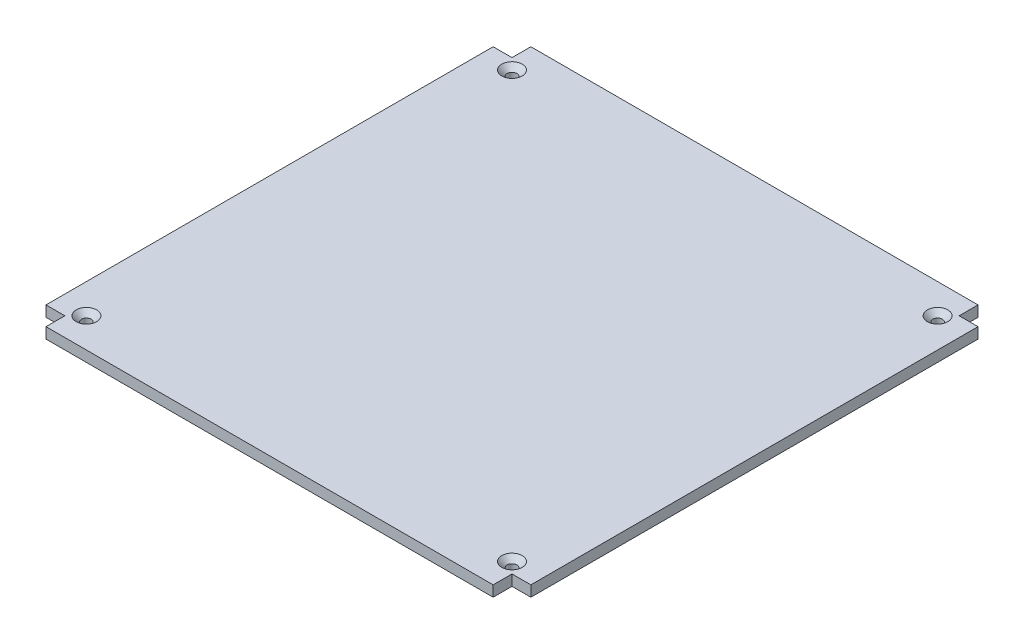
ISO-10303-21;
HEADER;
FILE_DESCRIPTION(('STEP AP214'),'2;1');
FILE_NAME('part.step','',(''),(''),'','','');
FILE_SCHEMA(('AUTOMOTIVE_DESIGN { 1 0 10303 214 1 1 1 1 }'));
ENDSEC;
DATA;
#1=APPLICATION_CONTEXT('core data for automotive mechanical design processes');
#2=APPLICATION_PROTOCOL_DEFINITION('international standard','automotive_design',2000,#1);
#3=PRODUCT_CONTEXT('',#1,'mechanical');
#4=PRODUCT('Part','Part','',(#3));
#5=PRODUCT_RELATED_PRODUCT_CATEGORY('part','',(#4));
#6=PRODUCT_DEFINITION_FORMATION('','',#4);
#7=PRODUCT_DEFINITION_CONTEXT('part definition',#1,'design');
#8=PRODUCT_DEFINITION('design','',#6,#7);
#9=PRODUCT_DEFINITION_SHAPE('','',#8);
#10=(LENGTH_UNIT() NAMED_UNIT(*) SI_UNIT(.MILLI.,.METRE.));
#11=(NAMED_UNIT(*) PLANE_ANGLE_UNIT() SI_UNIT($,.RADIAN.));
#12=(NAMED_UNIT(*) SI_UNIT($,.STERADIAN.) SOLID_ANGLE_UNIT());
#13=UNCERTAINTY_MEASURE_WITH_UNIT(LENGTH_MEASURE(1.E-05),#10,'distance_accuracy_value','');
#14=(GEOMETRIC_REPRESENTATION_CONTEXT(3) GLOBAL_UNCERTAINTY_ASSIGNED_CONTEXT((#13)) GLOBAL_UNIT_ASSIGNED_CONTEXT((#10,
#11,#12)) REPRESENTATION_CONTEXT('',''));
#15=CARTESIAN_POINT('',(0.,0.,0.));
#16=DIRECTION('',(0.,0.,1.));
#17=DIRECTION('',(1.,0.,0.));
#18=AXIS2_PLACEMENT_3D('',#15,#16,#17);
#19=CARTESIAN_POINT('',(0.,50.,0.));
#20=DIRECTION('',(0.,1.,0.));
#21=DIRECTION('',(0.,0.,1.));
#22=AXIS2_PLACEMENT_3D('',#19,#20,#21);
#23=PLANE('',#22);
#24=CARTESIAN_POINT('',(-39.5,50.,39.5));
#25=DIRECTION('',(0.,1.,0.));
#26=DIRECTION('',(0.,0.,1.));
#27=AXIS2_PLACEMENT_3D('',#24,#25,#26);
#28=CIRCLE('',#27,1.90000000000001);
#29=CARTESIAN_POINT('',(-39.5,50.,41.4));
#30=VERTEX_POINT('',#29);
#31=EDGE_CURVE('E215',#30,#30,#28,.F.);
#32=ORIENTED_EDGE('',*,*,#31,.T.);
#33=EDGE_LOOP('',(#32));
#34=FACE_BOUND('',#33,.T.);
#35=CARTESIAN_POINT('',(39.4999999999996,50.,39.5000000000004));
#36=DIRECTION('',(0.,1.,0.));
#37=DIRECTION('',(0.,0.,1.));
#38=AXIS2_PLACEMENT_3D('',#35,#36,#37);
#39=CIRCLE('',#38,1.90000000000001);
#40=CARTESIAN_POINT('',(39.4999999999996,50.,41.4000000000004));
#41=VERTEX_POINT('',#40);
#42=EDGE_CURVE('E212',#41,#41,#39,.F.);
#43=ORIENTED_EDGE('',*,*,#42,.T.);
#44=EDGE_LOOP('',(#43));
#45=FACE_BOUND('',#44,.T.);
#46=CARTESIAN_POINT('',(39.5,50.,-39.5));
#47=DIRECTION('',(0.,1.,0.));
#48=DIRECTION('',(0.,0.,1.));
#49=AXIS2_PLACEMENT_3D('',#46,#47,#48);
#50=CIRCLE('',#49,1.90000000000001);
#51=CARTESIAN_POINT('',(39.5,50.,-37.6));
#52=VERTEX_POINT('',#51);
#53=EDGE_CURVE('E209',#52,#52,#50,.F.);
#54=ORIENTED_EDGE('',*,*,#53,.T.);
#55=EDGE_LOOP('',(#54));
#56=FACE_BOUND('',#55,.T.);
#57=CARTESIAN_POINT('',(-39.4999999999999,50.,-39.5000000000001));
#58=DIRECTION('',(0.,1.,0.));
#59=DIRECTION('',(0.,0.,1.));
#60=AXIS2_PLACEMENT_3D('',#57,#58,#59);
#61=CIRCLE('',#60,1.90000000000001);
#62=CARTESIAN_POINT('',(-39.4999999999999,50.,-37.6000000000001));
#63=VERTEX_POINT('',#62);
#64=EDGE_CURVE('E206',#63,#63,#61,.F.);
#65=ORIENTED_EDGE('',*,*,#64,.T.);
#66=EDGE_LOOP('',(#65));
#67=FACE_BOUND('',#66,.T.);
#68=DIRECTION('',(1.,0.,-1.22917549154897E-13));
#69=VECTOR('',#68,1.);
#70=CARTESIAN_POINT('',(45.0000000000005,50.,41.5));
#71=LINE('',#70,#69);
#72=CARTESIAN_POINT('',(41.4999999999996,50.,41.5000000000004));
#73=VERTEX_POINT('',#72);
#74=CARTESIAN_POINT('',(45.0000000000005,50.,41.5));
#75=VERTEX_POINT('',#74);
#76=EDGE_CURVE('E176',#73,#75,#71,.T.);
#77=ORIENTED_EDGE('',*,*,#76,.T.);
#78=DIRECTION('',(0.,0.,-1.));
#79=VECTOR('',#78,1.);
#80=CARTESIAN_POINT('',(45.0000000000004,50.,-41.5));
#81=LINE('',#80,#79);
#82=CARTESIAN_POINT('',(45.0000000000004,50.,-41.5));
#83=VERTEX_POINT('',#82);
#84=EDGE_CURVE('E105',#75,#83,#81,.T.);
#85=ORIENTED_EDGE('',*,*,#84,.T.);
#86=DIRECTION('',(-1.,0.,0.));
#87=VECTOR('',#86,1.);
#88=CARTESIAN_POINT('',(45.0000000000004,50.,-41.5));
#89=LINE('',#88,#87);
#90=CARTESIAN_POINT('',(41.5,50.,-41.5));
#91=VERTEX_POINT('',#90);
#92=EDGE_CURVE('E324',#83,#91,#89,.T.);
#93=ORIENTED_EDGE('',*,*,#92,.T.);
#94=DIRECTION('',(0.,0.,-1.));
#95=VECTOR('',#94,1.);
#96=CARTESIAN_POINT('',(41.5,50.,-45.));
#97=LINE('',#96,#95);
#98=CARTESIAN_POINT('',(41.5,50.,-45.));
#99=VERTEX_POINT('',#98);
#100=EDGE_CURVE('E326',#91,#99,#97,.T.);
#101=ORIENTED_EDGE('',*,*,#100,.T.);
#102=DIRECTION('',(-1.,0.,0.));
#103=VECTOR('',#102,1.);
#104=CARTESIAN_POINT('',(41.5,50.,-45.));
#105=LINE('',#104,#103);
#106=CARTESIAN_POINT('',(-41.5,50.,-45.));
#107=VERTEX_POINT('',#106);
#108=EDGE_CURVE('E328',#99,#107,#105,.T.);
#109=ORIENTED_EDGE('',*,*,#108,.T.);
#110=DIRECTION('',(1.18952466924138E-13,0.,1.));
#111=VECTOR('',#110,1.);
#112=CARTESIAN_POINT('',(-41.5,50.,-45.));
#113=LINE('',#112,#111);
#114=CARTESIAN_POINT('',(-41.4999999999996,50.,-41.5000000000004));
#115=VERTEX_POINT('',#114);
#116=EDGE_CURVE('E330',#107,#115,#113,.T.);
#117=ORIENTED_EDGE('',*,*,#116,.T.);
#118=DIRECTION('',(-1.,0.,0.));
#119=VECTOR('',#118,1.);
#120=CARTESIAN_POINT('',(-45.0000000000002,50.,-41.5000000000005));
#121=LINE('',#120,#119);
#122=CARTESIAN_POINT('',(-45.0000000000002,50.,-41.5000000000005));
#123=VERTEX_POINT('',#122);
#124=EDGE_CURVE('E332',#115,#123,#121,.T.);
#125=ORIENTED_EDGE('',*,*,#124,.T.);
#126=DIRECTION('',(0.,0.,1.));
#127=VECTOR('',#126,1.);
#128=CARTESIAN_POINT('',(-45.0000000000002,50.,-41.5000000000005));
#129=LINE('',#128,#127);
#130=CARTESIAN_POINT('',(-45.0000000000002,50.,41.5));
#131=VERTEX_POINT('',#130);
#132=EDGE_CURVE('E334',#123,#131,#129,.T.);
#133=ORIENTED_EDGE('',*,*,#132,.T.);
#134=DIRECTION('',(1.,0.,0.));
#135=VECTOR('',#134,1.);
#136=CARTESIAN_POINT('',(-41.5,50.,41.5));
#137=LINE('',#136,#135);
#138=CARTESIAN_POINT('',(-41.5,50.,41.5));
#139=VERTEX_POINT('',#138);
#140=EDGE_CURVE('E135',#131,#139,#137,.T.);
#141=ORIENTED_EDGE('',*,*,#140,.T.);
#142=DIRECTION('',(0.,0.,1.));
#143=VECTOR('',#142,1.);
#144=CARTESIAN_POINT('',(-41.5,50.,45.));
#145=LINE('',#144,#143);
#146=CARTESIAN_POINT('',(-41.5,50.,45.));
#147=VERTEX_POINT('',#146);
#148=EDGE_CURVE('E130',#139,#147,#145,.T.);
#149=ORIENTED_EDGE('',*,*,#148,.T.);
#150=DIRECTION('',(1.,0.,0.));
#151=VECTOR('',#150,1.);
#152=CARTESIAN_POINT('',(41.4999999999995,50.,45.));
#153=LINE('',#152,#151);
#154=CARTESIAN_POINT('',(41.4999999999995,50.,45.));
#155=VERTEX_POINT('',#154);
#156=EDGE_CURVE('E133',#147,#155,#153,.T.);
#157=ORIENTED_EDGE('',*,*,#156,.T.);
#158=DIRECTION('',(0.,0.,-1.));
#159=VECTOR('',#158,1.);
#160=CARTESIAN_POINT('',(41.4999999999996,50.,41.5000000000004));
#161=LINE('',#160,#159);
#162=EDGE_CURVE('E49',#155,#73,#161,.T.);
#163=ORIENTED_EDGE('',*,*,#162,.T.);
#164=EDGE_LOOP('',(#77,#85,#93,#101,#109,#117,#125,#133,#141,#149,#157,#163));
#165=FACE_BOUND('',#164,.T.);
#166=ADVANCED_FACE('F32',(#34,#45,#56,#67,#165),#23,.T.);
#167=CARTESIAN_POINT('',(0.,48.,0.));
#168=DIRECTION('',(0.,1.,0.));
#169=DIRECTION('',(0.,0.,1.));
#170=AXIS2_PLACEMENT_3D('',#167,#168,#169);
#171=PLANE('',#170);
#172=DIRECTION('',(1.,0.,-1.22917549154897E-13));
#173=VECTOR('',#172,1.);
#174=CARTESIAN_POINT('',(45.0000000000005,48.,41.5));
#175=LINE('',#174,#173);
#176=CARTESIAN_POINT('',(41.4999999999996,48.,41.5000000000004));
#177=VERTEX_POINT('',#176);
#178=CARTESIAN_POINT('',(45.0000000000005,48.,41.5));
#179=VERTEX_POINT('',#178);
#180=EDGE_CURVE('E153',#177,#179,#175,.T.);
#181=ORIENTED_EDGE('',*,*,#180,.F.);
#182=DIRECTION('',(0.,0.,-1.));
#183=VECTOR('',#182,1.);
#184=CARTESIAN_POINT('',(41.4999999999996,48.,41.5000000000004));
#185=LINE('',#184,#183);
#186=CARTESIAN_POINT('',(41.4999999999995,48.,45.));
#187=VERTEX_POINT('',#186);
#188=EDGE_CURVE('E96',#187,#177,#185,.T.);
#189=ORIENTED_EDGE('',*,*,#188,.F.);
#190=DIRECTION('',(1.,0.,0.));
#191=VECTOR('',#190,1.);
#192=CARTESIAN_POINT('',(41.4999999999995,48.,45.));
#193=LINE('',#192,#191);
#194=CARTESIAN_POINT('',(-41.5,48.,45.));
#195=VERTEX_POINT('',#194);
#196=EDGE_CURVE('E90',#195,#187,#193,.T.);
#197=ORIENTED_EDGE('',*,*,#196,.F.);
#198=DIRECTION('',(0.,0.,1.));
#199=VECTOR('',#198,1.);
#200=CARTESIAN_POINT('',(-41.5,48.,45.));
#201=LINE('',#200,#199);
#202=CARTESIAN_POINT('',(-41.5,48.,41.5));
#203=VERTEX_POINT('',#202);
#204=EDGE_CURVE('E143',#203,#195,#201,.T.);
#205=ORIENTED_EDGE('',*,*,#204,.F.);
#206=DIRECTION('',(1.,0.,0.));
#207=VECTOR('',#206,1.);
#208=CARTESIAN_POINT('',(-41.5,48.,41.5));
#209=LINE('',#208,#207);
#210=CARTESIAN_POINT('',(-45.0000000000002,48.,41.5));
#211=VERTEX_POINT('',#210);
#212=EDGE_CURVE('E171',#211,#203,#209,.T.);
#213=ORIENTED_EDGE('',*,*,#212,.F.);
#214=DIRECTION('',(0.,0.,1.));
#215=VECTOR('',#214,1.);
#216=CARTESIAN_POINT('',(-45.0000000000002,48.,-41.5000000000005));
#217=LINE('',#216,#215);
#218=CARTESIAN_POINT('',(-45.0000000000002,48.,-41.5000000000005));
#219=VERTEX_POINT('',#218);
#220=EDGE_CURVE('E169',#219,#211,#217,.T.);
#221=ORIENTED_EDGE('',*,*,#220,.F.);
#222=DIRECTION('',(-1.,0.,0.));
#223=VECTOR('',#222,1.);
#224=CARTESIAN_POINT('',(-45.0000000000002,48.,-41.5000000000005));
#225=LINE('',#224,#223);
#226=CARTESIAN_POINT('',(-41.4999999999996,48.,-41.5000000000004));
#227=VERTEX_POINT('',#226);
#228=EDGE_CURVE('E167',#227,#219,#225,.T.);
#229=ORIENTED_EDGE('',*,*,#228,.F.);
#230=DIRECTION('',(1.18952466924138E-13,0.,1.));
#231=VECTOR('',#230,1.);
#232=CARTESIAN_POINT('',(-41.5,48.,-45.));
#233=LINE('',#232,#231);
#234=CARTESIAN_POINT('',(-41.5,48.,-45.));
#235=VERTEX_POINT('',#234);
#236=EDGE_CURVE('E165',#235,#227,#233,.T.);
#237=ORIENTED_EDGE('',*,*,#236,.F.);
#238=DIRECTION('',(-1.,0.,0.));
#239=VECTOR('',#238,1.);
#240=CARTESIAN_POINT('',(41.5,48.,-45.));
#241=LINE('',#240,#239);
#242=CARTESIAN_POINT('',(41.5,48.,-45.));
#243=VERTEX_POINT('',#242);
#244=EDGE_CURVE('E163',#243,#235,#241,.T.);
#245=ORIENTED_EDGE('',*,*,#244,.F.);
#246=DIRECTION('',(0.,0.,-1.));
#247=VECTOR('',#246,1.);
#248=CARTESIAN_POINT('',(41.5,48.,-45.));
#249=LINE('',#248,#247);
#250=CARTESIAN_POINT('',(41.5,48.,-41.5));
#251=VERTEX_POINT('',#250);
#252=EDGE_CURVE('E161',#251,#243,#249,.T.);
#253=ORIENTED_EDGE('',*,*,#252,.F.);
#254=DIRECTION('',(-1.,0.,0.));
#255=VECTOR('',#254,1.);
#256=CARTESIAN_POINT('',(45.0000000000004,48.,-41.5));
#257=LINE('',#256,#255);
#258=CARTESIAN_POINT('',(45.0000000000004,48.,-41.5));
#259=VERTEX_POINT('',#258);
#260=EDGE_CURVE('E159',#259,#251,#257,.T.);
#261=ORIENTED_EDGE('',*,*,#260,.F.);
#262=DIRECTION('',(0.,0.,-1.));
#263=VECTOR('',#262,1.);
#264=CARTESIAN_POINT('',(45.0000000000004,48.,-41.5));
#265=LINE('',#264,#263);
#266=EDGE_CURVE('E156',#179,#259,#265,.T.);
#267=ORIENTED_EDGE('',*,*,#266,.F.);
#268=EDGE_LOOP('',(#181,#189,#197,#205,#213,#221,#229,#237,#245,#253,#261,#267));
#269=FACE_BOUND('',#268,.T.);
#270=CARTESIAN_POINT('',(-39.4999999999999,48.,-39.5000000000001));
#271=DIRECTION('',(0.,1.,0.));
#272=DIRECTION('',(0.,0.,1.));
#273=AXIS2_PLACEMENT_3D('',#270,#271,#272);
#274=CIRCLE('',#273,0.900000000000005);
#275=CARTESIAN_POINT('',(-39.4999999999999,48.,-38.6000000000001));
#276=VERTEX_POINT('',#275);
#277=EDGE_CURVE('E157',#276,#276,#274,.T.);
#278=ORIENTED_EDGE('',*,*,#277,.T.);
#279=EDGE_LOOP('',(#278));
#280=FACE_BOUND('',#279,.T.);
#281=CARTESIAN_POINT('',(39.5,48.,-39.5));
#282=DIRECTION('',(0.,1.,0.));
#283=DIRECTION('',(0.,0.,1.));
#284=AXIS2_PLACEMENT_3D('',#281,#282,#283);
#285=CIRCLE('',#284,0.900000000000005);
#286=CARTESIAN_POINT('',(39.5,48.,-38.6));
#287=VERTEX_POINT('',#286);
#288=EDGE_CURVE('E315',#287,#287,#285,.T.);
#289=ORIENTED_EDGE('',*,*,#288,.T.);
#290=EDGE_LOOP('',(#289));
#291=FACE_BOUND('',#290,.T.);
#292=CARTESIAN_POINT('',(39.4999999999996,48.,39.5000000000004));
#293=DIRECTION('',(0.,1.,0.));
#294=DIRECTION('',(0.,0.,1.));
#295=AXIS2_PLACEMENT_3D('',#292,#293,#294);
#296=CIRCLE('',#295,0.900000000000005);
#297=CARTESIAN_POINT('',(39.4999999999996,48.,40.4000000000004));
#298=VERTEX_POINT('',#297);
#299=EDGE_CURVE('E312',#298,#298,#296,.T.);
#300=ORIENTED_EDGE('',*,*,#299,.T.);
#301=EDGE_LOOP('',(#300));
#302=FACE_BOUND('',#301,.T.);
#303=CARTESIAN_POINT('',(-39.5,48.,39.5));
#304=DIRECTION('',(0.,1.,0.));
#305=DIRECTION('',(0.,0.,1.));
#306=AXIS2_PLACEMENT_3D('',#303,#304,#305);
#307=CIRCLE('',#306,0.900000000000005);
#308=CARTESIAN_POINT('',(-39.5,48.,40.4));
#309=VERTEX_POINT('',#308);
#310=EDGE_CURVE('E310',#309,#309,#307,.T.);
#311=ORIENTED_EDGE('',*,*,#310,.T.);
#312=EDGE_LOOP('',(#311));
#313=FACE_BOUND('',#312,.T.);
#314=ADVANCED_FACE('F240',(#269,#280,#291,#302,#313),#171,.F.);
#315=CARTESIAN_POINT('',(45.0000000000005,50.,41.5));
#316=DIRECTION('',(-1.22917549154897E-13,0.,-1.));
#317=DIRECTION('',(-1.,0.,1.22917549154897E-13));
#318=AXIS2_PLACEMENT_3D('',#315,#316,#317);
#319=PLANE('',#318);
#320=ORIENTED_EDGE('',*,*,#180,.T.);
#321=DIRECTION('',(0.,-1.,0.));
#322=VECTOR('',#321,1.);
#323=CARTESIAN_POINT('',(45.0000000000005,50.,41.5));
#324=LINE('',#323,#322);
#325=EDGE_CURVE('E201',#75,#179,#324,.T.);
#326=ORIENTED_EDGE('',*,*,#325,.F.);
#327=ORIENTED_EDGE('',*,*,#76,.F.);
#328=DIRECTION('',(0.,-1.,0.));
#329=VECTOR('',#328,1.);
#330=CARTESIAN_POINT('',(41.4999999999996,50.,41.5000000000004));
#331=LINE('',#330,#329);
#332=EDGE_CURVE('E149',#73,#177,#331,.T.);
#333=ORIENTED_EDGE('',*,*,#332,.T.);
#334=EDGE_LOOP('',(#320,#326,#327,#333));
#335=FACE_BOUND('',#334,.T.);
#336=ADVANCED_FACE('F246',(#335),#319,.F.);
#337=CARTESIAN_POINT('',(45.0000000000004,50.,-41.5));
#338=DIRECTION('',(-1.,0.,0.));
#339=DIRECTION('',(0.,0.,1.));
#340=AXIS2_PLACEMENT_3D('',#337,#338,#339);
#341=PLANE('',#340);
#342=ORIENTED_EDGE('',*,*,#266,.T.);
#343=DIRECTION('',(0.,-1.,0.));
#344=VECTOR('',#343,1.);
#345=CARTESIAN_POINT('',(45.0000000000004,50.,-41.5));
#346=LINE('',#345,#344);
#347=EDGE_CURVE('E198',#83,#259,#346,.T.);
#348=ORIENTED_EDGE('',*,*,#347,.F.);
#349=ORIENTED_EDGE('',*,*,#84,.F.);
#350=ORIENTED_EDGE('',*,*,#325,.T.);
#351=EDGE_LOOP('',(#342,#348,#349,#350));
#352=FACE_BOUND('',#351,.T.);
#353=ADVANCED_FACE('F288',(#352),#341,.F.);
#354=CARTESIAN_POINT('',(45.0000000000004,50.,-41.5));
#355=DIRECTION('',(0.,0.,1.));
#356=DIRECTION('',(1.,0.,0.));
#357=AXIS2_PLACEMENT_3D('',#354,#355,#356);
#358=PLANE('',#357);
#359=ORIENTED_EDGE('',*,*,#260,.T.);
#360=DIRECTION('',(0.,-1.,0.));
#361=VECTOR('',#360,1.);
#362=CARTESIAN_POINT('',(41.5,50.,-41.5));
#363=LINE('',#362,#361);
#364=EDGE_CURVE('E195',#91,#251,#363,.T.);
#365=ORIENTED_EDGE('',*,*,#364,.F.);
#366=ORIENTED_EDGE('',*,*,#92,.F.);
#367=ORIENTED_EDGE('',*,*,#347,.T.);
#368=EDGE_LOOP('',(#359,#365,#366,#367));
#369=FACE_BOUND('',#368,.T.);
#370=ADVANCED_FACE('F284',(#369),#358,.F.);
#371=CARTESIAN_POINT('',(41.5,50.,-45.));
#372=DIRECTION('',(-1.,0.,0.));
#373=DIRECTION('',(0.,0.,1.));
#374=AXIS2_PLACEMENT_3D('',#371,#372,#373);
#375=PLANE('',#374);
#376=ORIENTED_EDGE('',*,*,#252,.T.);
#377=DIRECTION('',(0.,-1.,0.));
#378=VECTOR('',#377,1.);
#379=CARTESIAN_POINT('',(41.5,50.,-45.));
#380=LINE('',#379,#378);
#381=EDGE_CURVE('E192',#99,#243,#380,.T.);
#382=ORIENTED_EDGE('',*,*,#381,.F.);
#383=ORIENTED_EDGE('',*,*,#100,.F.);
#384=ORIENTED_EDGE('',*,*,#364,.T.);
#385=EDGE_LOOP('',(#376,#382,#383,#384));
#386=FACE_BOUND('',#385,.T.);
#387=ADVANCED_FACE('F280',(#386),#375,.F.);
#388=CARTESIAN_POINT('',(41.5,50.,-45.));
#389=DIRECTION('',(0.,0.,1.));
#390=DIRECTION('',(1.,0.,0.));
#391=AXIS2_PLACEMENT_3D('',#388,#389,#390);
#392=PLANE('',#391);
#393=ORIENTED_EDGE('',*,*,#244,.T.);
#394=DIRECTION('',(0.,-1.,0.));
#395=VECTOR('',#394,1.);
#396=CARTESIAN_POINT('',(-41.5,50.,-45.));
#397=LINE('',#396,#395);
#398=EDGE_CURVE('E189',#107,#235,#397,.T.);
#399=ORIENTED_EDGE('',*,*,#398,.F.);
#400=ORIENTED_EDGE('',*,*,#108,.F.);
#401=ORIENTED_EDGE('',*,*,#381,.T.);
#402=EDGE_LOOP('',(#393,#399,#400,#401));
#403=FACE_BOUND('',#402,.T.);
#404=ADVANCED_FACE('F276',(#403),#392,.F.);
#405=CARTESIAN_POINT('',(-41.5,50.,-45.));
#406=DIRECTION('',(1.,0.,-1.18952466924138E-13));
#407=DIRECTION('',(-1.18952466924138E-13,0.,-1.));
#408=AXIS2_PLACEMENT_3D('',#405,#406,#407);
#409=PLANE('',#408);
#410=ORIENTED_EDGE('',*,*,#236,.T.);
#411=DIRECTION('',(0.,-1.,0.));
#412=VECTOR('',#411,1.);
#413=CARTESIAN_POINT('',(-41.4999999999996,50.,-41.5000000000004));
#414=LINE('',#413,#412);
#415=EDGE_CURVE('E186',#115,#227,#414,.T.);
#416=ORIENTED_EDGE('',*,*,#415,.F.);
#417=ORIENTED_EDGE('',*,*,#116,.F.);
#418=ORIENTED_EDGE('',*,*,#398,.T.);
#419=EDGE_LOOP('',(#410,#416,#417,#418));
#420=FACE_BOUND('',#419,.T.);
#421=ADVANCED_FACE('F272',(#420),#409,.F.);
#422=CARTESIAN_POINT('',(-45.0000000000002,50.,-41.5000000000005));
#423=DIRECTION('',(0.,0.,1.));
#424=DIRECTION('',(1.,0.,0.));
#425=AXIS2_PLACEMENT_3D('',#422,#423,#424);
#426=PLANE('',#425);
#427=ORIENTED_EDGE('',*,*,#228,.T.);
#428=DIRECTION('',(0.,-1.,0.));
#429=VECTOR('',#428,1.);
#430=CARTESIAN_POINT('',(-45.0000000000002,50.,-41.5000000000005));
#431=LINE('',#430,#429);
#432=EDGE_CURVE('E183',#123,#219,#431,.T.);
#433=ORIENTED_EDGE('',*,*,#432,.F.);
#434=ORIENTED_EDGE('',*,*,#124,.F.);
#435=ORIENTED_EDGE('',*,*,#415,.T.);
#436=EDGE_LOOP('',(#427,#433,#434,#435));
#437=FACE_BOUND('',#436,.T.);
#438=ADVANCED_FACE('F268',(#437),#426,.F.);
#439=CARTESIAN_POINT('',(-45.0000000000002,50.,-41.5000000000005));
#440=DIRECTION('',(1.,0.,0.));
#441=DIRECTION('',(0.,0.,-1.));
#442=AXIS2_PLACEMENT_3D('',#439,#440,#441);
#443=PLANE('',#442);
#444=ORIENTED_EDGE('',*,*,#220,.T.);
#445=DIRECTION('',(0.,-1.,0.));
#446=VECTOR('',#445,1.);
#447=CARTESIAN_POINT('',(-45.0000000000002,50.,41.5));
#448=LINE('',#447,#446);
#449=EDGE_CURVE('E180',#131,#211,#448,.T.);
#450=ORIENTED_EDGE('',*,*,#449,.F.);
#451=ORIENTED_EDGE('',*,*,#132,.F.);
#452=ORIENTED_EDGE('',*,*,#432,.T.);
#453=EDGE_LOOP('',(#444,#450,#451,#452));
#454=FACE_BOUND('',#453,.T.);
#455=ADVANCED_FACE('F264',(#454),#443,.F.);
#456=CARTESIAN_POINT('',(-41.5,50.,41.5));
#457=DIRECTION('',(0.,0.,-1.));
#458=DIRECTION('',(-1.,0.,0.));
#459=AXIS2_PLACEMENT_3D('',#456,#457,#458);
#460=PLANE('',#459);
#461=ORIENTED_EDGE('',*,*,#212,.T.);
#462=DIRECTION('',(0.,-1.,0.));
#463=VECTOR('',#462,1.);
#464=CARTESIAN_POINT('',(-41.5,50.,41.5));
#465=LINE('',#464,#463);
#466=EDGE_CURVE('E144',#139,#203,#465,.T.);
#467=ORIENTED_EDGE('',*,*,#466,.F.);
#468=ORIENTED_EDGE('',*,*,#140,.F.);
#469=ORIENTED_EDGE('',*,*,#449,.T.);
#470=EDGE_LOOP('',(#461,#467,#468,#469));
#471=FACE_BOUND('',#470,.T.);
#472=ADVANCED_FACE('F261',(#471),#460,.F.);
#473=CARTESIAN_POINT('',(-41.5,50.,45.));
#474=DIRECTION('',(1.,0.,0.));
#475=DIRECTION('',(0.,0.,-1.));
#476=AXIS2_PLACEMENT_3D('',#473,#474,#475);
#477=PLANE('',#476);
#478=ORIENTED_EDGE('',*,*,#204,.T.);
#479=DIRECTION('',(0.,-1.,0.));
#480=VECTOR('',#479,1.);
#481=CARTESIAN_POINT('',(-41.5,50.,45.));
#482=LINE('',#481,#480);
#483=EDGE_CURVE('E140',#147,#195,#482,.T.);
#484=ORIENTED_EDGE('',*,*,#483,.F.);
#485=ORIENTED_EDGE('',*,*,#148,.F.);
#486=ORIENTED_EDGE('',*,*,#466,.T.);
#487=EDGE_LOOP('',(#478,#484,#485,#486));
#488=FACE_BOUND('',#487,.T.);
#489=ADVANCED_FACE('F141',(#488),#477,.F.);
#490=CARTESIAN_POINT('',(41.4999999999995,50.,45.));
#491=DIRECTION('',(0.,0.,-1.));
#492=DIRECTION('',(-1.,0.,0.));
#493=AXIS2_PLACEMENT_3D('',#490,#491,#492);
#494=PLANE('',#493);
#495=ORIENTED_EDGE('',*,*,#196,.T.);
#496=DIRECTION('',(0.,-1.,0.));
#497=VECTOR('',#496,1.);
#498=CARTESIAN_POINT('',(41.4999999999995,50.,45.));
#499=LINE('',#498,#497);
#500=EDGE_CURVE('E145',#155,#187,#499,.T.);
#501=ORIENTED_EDGE('',*,*,#500,.F.);
#502=ORIENTED_EDGE('',*,*,#156,.F.);
#503=ORIENTED_EDGE('',*,*,#483,.T.);
#504=EDGE_LOOP('',(#495,#501,#502,#503));
#505=FACE_BOUND('',#504,.T.);
#506=ADVANCED_FACE('F147',(#505),#494,.F.);
#507=CARTESIAN_POINT('',(41.4999999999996,50.,41.5000000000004));
#508=DIRECTION('',(-1.,0.,0.));
#509=DIRECTION('',(0.,0.,1.));
#510=AXIS2_PLACEMENT_3D('',#507,#508,#509);
#511=PLANE('',#510);
#512=ORIENTED_EDGE('',*,*,#188,.T.);
#513=ORIENTED_EDGE('',*,*,#332,.F.);
#514=ORIENTED_EDGE('',*,*,#162,.F.);
#515=ORIENTED_EDGE('',*,*,#500,.T.);
#516=EDGE_LOOP('',(#512,#513,#514,#515));
#517=FACE_BOUND('',#516,.T.);
#518=ADVANCED_FACE('F254',(#517),#511,.F.);
#519=CARTESIAN_POINT('',(-39.4999999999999,50.,-39.5000000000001));
#520=DIRECTION('',(0.,-1.,0.));
#521=DIRECTION('',(0.,0.,-1.));
#522=AXIS2_PLACEMENT_3D('',#519,#520,#521);
#523=CYLINDRICAL_SURFACE('',#522,0.900000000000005);
#524=CARTESIAN_POINT('',(-39.4999999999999,49.,-39.5000000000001));
#525=DIRECTION('',(0.,1.,0.));
#526=DIRECTION('',(0.,0.,1.));
#527=AXIS2_PLACEMENT_3D('',#524,#525,#526);
#528=CIRCLE('',#527,0.900000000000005);
#529=CARTESIAN_POINT('',(-39.4999999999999,49.,-38.6000000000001));
#530=VERTEX_POINT('',#529);
#531=EDGE_CURVE('E11',#530,#530,#528,.T.);
#532=ORIENTED_EDGE('',*,*,#531,.T.);
#533=EDGE_LOOP('',(#532));
#534=FACE_BOUND('',#533,.T.);
#535=ORIENTED_EDGE('',*,*,#277,.F.);
#536=EDGE_LOOP('',(#535));
#537=FACE_BOUND('',#536,.T.);
#538=ADVANCED_FACE('F251',(#534,#537),#523,.F.);
#539=CARTESIAN_POINT('',(39.5,50.,-39.5));
#540=DIRECTION('',(0.,-1.,0.));
#541=DIRECTION('',(0.,0.,-1.));
#542=AXIS2_PLACEMENT_3D('',#539,#540,#541);
#543=CYLINDRICAL_SURFACE('',#542,0.900000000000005);
#544=CARTESIAN_POINT('',(39.5,49.,-39.5));
#545=DIRECTION('',(0.,1.,0.));
#546=DIRECTION('',(0.,0.,1.));
#547=AXIS2_PLACEMENT_3D('',#544,#545,#546);
#548=CIRCLE('',#547,0.900000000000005);
#549=CARTESIAN_POINT('',(39.5,49.,-38.6));
#550=VERTEX_POINT('',#549);
#551=EDGE_CURVE('E41',#550,#550,#548,.T.);
#552=ORIENTED_EDGE('',*,*,#551,.T.);
#553=EDGE_LOOP('',(#552));
#554=FACE_BOUND('',#553,.T.);
#555=ORIENTED_EDGE('',*,*,#288,.F.);
#556=EDGE_LOOP('',(#555));
#557=FACE_BOUND('',#556,.T.);
#558=ADVANCED_FACE('F223',(#554,#557),#543,.F.);
#559=CARTESIAN_POINT('',(39.4999999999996,50.,39.5000000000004));
#560=DIRECTION('',(0.,-1.,0.));
#561=DIRECTION('',(0.,0.,-1.));
#562=AXIS2_PLACEMENT_3D('',#559,#560,#561);
#563=CYLINDRICAL_SURFACE('',#562,0.900000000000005);
#564=CARTESIAN_POINT('',(39.4999999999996,49.,39.5000000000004));
#565=DIRECTION('',(0.,1.,0.));
#566=DIRECTION('',(0.,0.,1.));
#567=AXIS2_PLACEMENT_3D('',#564,#565,#566);
#568=CIRCLE('',#567,0.900000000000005);
#569=CARTESIAN_POINT('',(39.4999999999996,49.,40.4000000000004));
#570=VERTEX_POINT('',#569);
#571=EDGE_CURVE('E218',#570,#570,#568,.T.);
#572=ORIENTED_EDGE('',*,*,#571,.T.);
#573=EDGE_LOOP('',(#572));
#574=FACE_BOUND('',#573,.T.);
#575=ORIENTED_EDGE('',*,*,#299,.F.);
#576=EDGE_LOOP('',(#575));
#577=FACE_BOUND('',#576,.T.);
#578=ADVANCED_FACE('F301',(#574,#577),#563,.F.);
#579=CARTESIAN_POINT('',(-39.5,50.,39.5));
#580=DIRECTION('',(0.,-1.,0.));
#581=DIRECTION('',(0.,0.,-1.));
#582=AXIS2_PLACEMENT_3D('',#579,#580,#581);
#583=CYLINDRICAL_SURFACE('',#582,0.900000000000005);
#584=CARTESIAN_POINT('',(-39.5,49.,39.5));
#585=DIRECTION('',(0.,1.,0.));
#586=DIRECTION('',(0.,0.,1.));
#587=AXIS2_PLACEMENT_3D('',#584,#585,#586);
#588=CIRCLE('',#587,0.900000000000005);
#589=CARTESIAN_POINT('',(-39.5,49.,40.4));
#590=VERTEX_POINT('',#589);
#591=EDGE_CURVE('E203',#590,#590,#588,.T.);
#592=ORIENTED_EDGE('',*,*,#591,.T.);
#593=EDGE_LOOP('',(#592));
#594=FACE_BOUND('',#593,.T.);
#595=ORIENTED_EDGE('',*,*,#310,.F.);
#596=EDGE_LOOP('',(#595));
#597=FACE_BOUND('',#596,.T.);
#598=ADVANCED_FACE('F296',(#594,#597),#583,.F.);
#599=CARTESIAN_POINT('',(-39.5,49.,39.5));
#600=DIRECTION('',(0.,1.,0.));
#601=DIRECTION('',(0.,0.,1.));
#602=AXIS2_PLACEMENT_3D('',#599,#600,#601);
#603=CONICAL_SURFACE('',#602,0.900000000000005,0.785398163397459);
#604=ORIENTED_EDGE('',*,*,#31,.F.);
#605=EDGE_LOOP('',(#604));
#606=FACE_BOUND('',#605,.T.);
#607=ORIENTED_EDGE('',*,*,#591,.F.);
#608=EDGE_LOOP('',(#607));
#609=FACE_BOUND('',#608,.T.);
#610=ADVANCED_FACE('F235',(#606,#609),#603,.F.);
#611=CARTESIAN_POINT('',(39.4999999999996,49.,39.5000000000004));
#612=DIRECTION('',(0.,1.,0.));
#613=DIRECTION('',(0.,0.,1.));
#614=AXIS2_PLACEMENT_3D('',#611,#612,#613);
#615=CONICAL_SURFACE('',#614,0.900000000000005,0.785398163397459);
#616=ORIENTED_EDGE('',*,*,#42,.F.);
#617=EDGE_LOOP('',(#616));
#618=FACE_BOUND('',#617,.T.);
#619=ORIENTED_EDGE('',*,*,#571,.F.);
#620=EDGE_LOOP('',(#619));
#621=FACE_BOUND('',#620,.T.);
#622=ADVANCED_FACE('F228',(#618,#621),#615,.F.);
#623=CARTESIAN_POINT('',(39.5,49.,-39.5));
#624=DIRECTION('',(0.,1.,0.));
#625=DIRECTION('',(0.,0.,1.));
#626=AXIS2_PLACEMENT_3D('',#623,#624,#625);
#627=CONICAL_SURFACE('',#626,0.900000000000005,0.785398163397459);
#628=ORIENTED_EDGE('',*,*,#53,.F.);
#629=EDGE_LOOP('',(#628));
#630=FACE_BOUND('',#629,.T.);
#631=ORIENTED_EDGE('',*,*,#551,.F.);
#632=EDGE_LOOP('',(#631));
#633=FACE_BOUND('',#632,.T.);
#634=ADVANCED_FACE('F226',(#630,#633),#627,.F.);
#635=CARTESIAN_POINT('',(-39.4999999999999,49.,-39.5000000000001));
#636=DIRECTION('',(0.,1.,0.));
#637=DIRECTION('',(0.,0.,1.));
#638=AXIS2_PLACEMENT_3D('',#635,#636,#637);
#639=CONICAL_SURFACE('',#638,0.900000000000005,0.785398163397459);
#640=ORIENTED_EDGE('',*,*,#64,.F.);
#641=EDGE_LOOP('',(#640));
#642=FACE_BOUND('',#641,.T.);
#643=ORIENTED_EDGE('',*,*,#531,.F.);
#644=EDGE_LOOP('',(#643));
#645=FACE_BOUND('',#644,.T.);
#646=ADVANCED_FACE('F34',(#642,#645),#639,.F.);
#647=CLOSED_SHELL('',(#166,#314,#336,#353,#370,#387,#404,#421,#438,#455,#472,#489,#506,#518,
#538,#558,#578,#598,#610,#622,#634,#646));
#648=MANIFOLD_SOLID_BREP('B2',#647);
#649=ADVANCED_BREP_SHAPE_REPRESENTATION('',(#18,#648),#14);
#650=SHAPE_DEFINITION_REPRESENTATION(#9,#649);
ENDSEC;
END-ISO-10303-21;
